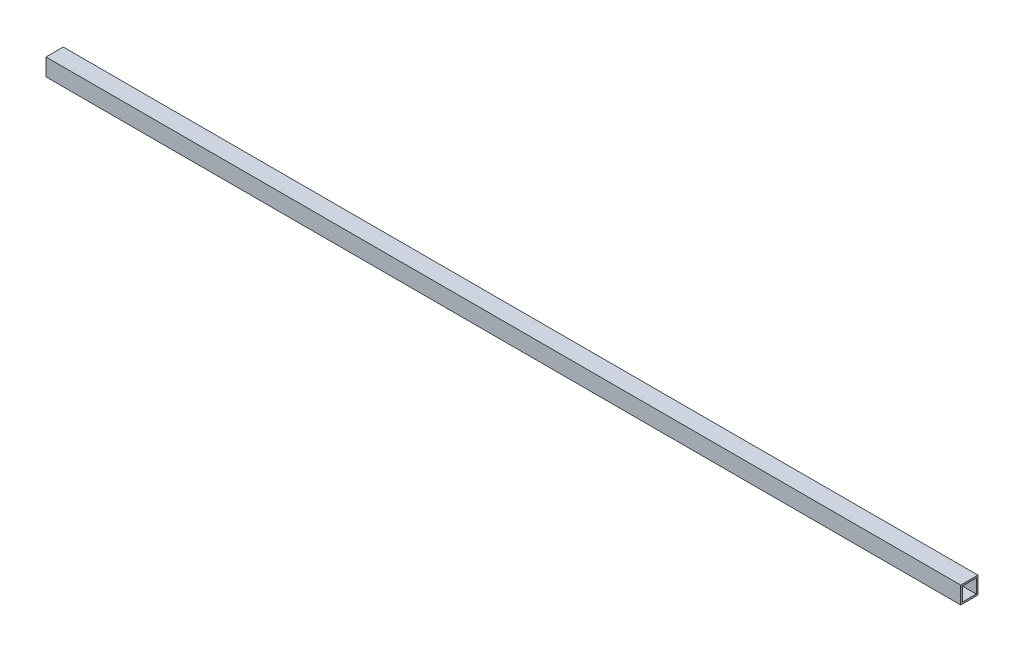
from build123d import *

# Parameters (mm, degrees)
ESQUISSE1_W        = 20
ESQUISSE1_H        = 20
ESQUISSE1_W_2      = 16
ESQUISSE1_H_2      = 16
BOSS_EXTRU_1_DEPTH = 1060


with BuildPart() as part:
    # Esquisse1 → Boss.-Extru.1 (new body)
    with BuildSketch(Plane(origin=(0, 0, 0), x_dir=(0, 0, -1), z_dir=(1, 0, 0))):
        with Locations((10, 10)):
            Rectangle(ESQUISSE1_W, ESQUISSE1_H)
        with Locations((10, 10)):
            Rectangle(ESQUISSE1_W_2, ESQUISSE1_H_2, mode=Mode.SUBTRACT)
    extrude(amount=BOSS_EXTRU_1_DEPTH)


solid = part.part
